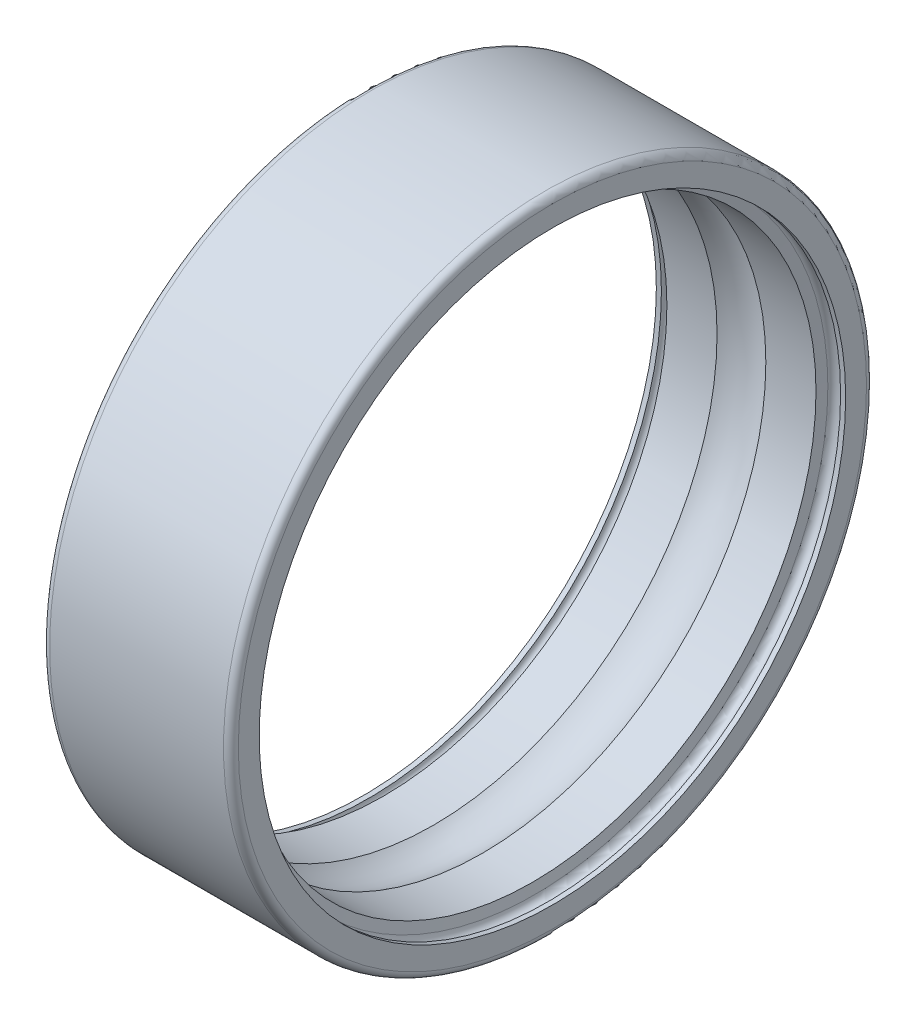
ISO-10303-21;
HEADER;
FILE_DESCRIPTION(('STEP AP214'),'2;1');
FILE_NAME('part.step','',(''),(''),'','','');
FILE_SCHEMA(('AUTOMOTIVE_DESIGN { 1 0 10303 214 1 1 1 1 }'));
ENDSEC;
DATA;
#1=APPLICATION_CONTEXT('core data for automotive mechanical design processes');
#2=APPLICATION_PROTOCOL_DEFINITION('international standard','automotive_design',2000,#1);
#3=PRODUCT_CONTEXT('',#1,'mechanical');
#4=PRODUCT('Part','Part','',(#3));
#5=PRODUCT_RELATED_PRODUCT_CATEGORY('part','',(#4));
#6=PRODUCT_DEFINITION_FORMATION('','',#4);
#7=PRODUCT_DEFINITION_CONTEXT('part definition',#1,'design');
#8=PRODUCT_DEFINITION('design','',#6,#7);
#9=PRODUCT_DEFINITION_SHAPE('','',#8);
#10=(LENGTH_UNIT() NAMED_UNIT(*) SI_UNIT(.MILLI.,.METRE.));
#11=(NAMED_UNIT(*) PLANE_ANGLE_UNIT() SI_UNIT($,.RADIAN.));
#12=(NAMED_UNIT(*) SI_UNIT($,.STERADIAN.) SOLID_ANGLE_UNIT());
#13=UNCERTAINTY_MEASURE_WITH_UNIT(LENGTH_MEASURE(1.E-05),#10,'distance_accuracy_value','');
#14=(GEOMETRIC_REPRESENTATION_CONTEXT(3) GLOBAL_UNCERTAINTY_ASSIGNED_CONTEXT((#13)) GLOBAL_UNIT_ASSIGNED_CONTEXT((#10,
#11,#12)) REPRESENTATION_CONTEXT('',''));
#15=CARTESIAN_POINT('',(0.,0.,0.));
#16=DIRECTION('',(0.,0.,1.));
#17=DIRECTION('',(1.,0.,0.));
#18=AXIS2_PLACEMENT_3D('',#15,#16,#17);
#19=CARTESIAN_POINT('',(0.200000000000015,0.,0.));
#20=DIRECTION('',(1.,0.,0.));
#21=DIRECTION('',(0.,0.,-1.));
#22=AXIS2_PLACEMENT_3D('',#19,#20,#21);
#23=TOROIDAL_SURFACE('',#22,8.29999999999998,0.200000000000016);
#24=CARTESIAN_POINT('',(0.,0.,0.));
#25=DIRECTION('',(1.,0.,0.));
#26=DIRECTION('',(0.,0.,-1.));
#27=AXIS2_PLACEMENT_3D('',#24,#25,#26);
#28=CIRCLE('',#27,8.29999999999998);
#29=CARTESIAN_POINT('',(0.,0.,-8.29999999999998));
#30=VERTEX_POINT('',#29);
#31=EDGE_CURVE('E10',#30,#30,#28,.T.);
#32=ORIENTED_EDGE('',*,*,#31,.T.);
#33=EDGE_LOOP('',(#32));
#34=FACE_BOUND('',#33,.T.);
#35=CARTESIAN_POINT('',(0.199999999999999,0.,0.));
#36=DIRECTION('',(1.,0.,0.));
#37=DIRECTION('',(0.,0.,-1.));
#38=AXIS2_PLACEMENT_3D('',#35,#36,#37);
#39=CIRCLE('',#38,8.5);
#40=CARTESIAN_POINT('',(0.199999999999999,0.,-8.5));
#41=VERTEX_POINT('',#40);
#42=EDGE_CURVE('E82',#41,#41,#39,.T.);
#43=ORIENTED_EDGE('',*,*,#42,.F.);
#44=EDGE_LOOP('',(#43));
#45=FACE_BOUND('',#44,.T.);
#46=ADVANCED_FACE('F36',(#34,#45),#23,.T.);
#47=CARTESIAN_POINT('',(0.,8.29999999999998,0.));
#48=DIRECTION('',(-1.,0.,0.));
#49=DIRECTION('',(0.,0.,1.));
#50=AXIS2_PLACEMENT_3D('',#47,#48,#49);
#51=PLANE('',#50);
#52=CARTESIAN_POINT('',(0.,0.,0.));
#53=DIRECTION('',(1.,0.,0.));
#54=DIRECTION('',(0.,0.,-1.));
#55=AXIS2_PLACEMENT_3D('',#52,#53,#54);
#56=CIRCLE('',#55,7.74874355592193);
#57=CARTESIAN_POINT('',(0.,0.,-7.74874355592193));
#58=VERTEX_POINT('',#57);
#59=EDGE_CURVE('E42',#58,#58,#56,.T.);
#60=ORIENTED_EDGE('',*,*,#59,.T.);
#61=EDGE_LOOP('',(#60));
#62=FACE_BOUND('',#61,.T.);
#63=ORIENTED_EDGE('',*,*,#31,.F.);
#64=EDGE_LOOP('',(#63));
#65=FACE_BOUND('',#64,.T.);
#66=ADVANCED_FACE('F90',(#62,#65),#51,.T.);
#67=CARTESIAN_POINT('',(0.,0.,0.));
#68=DIRECTION('',(1.,0.,0.));
#69=DIRECTION('',(0.,0.,-1.));
#70=AXIS2_PLACEMENT_3D('',#67,#68,#69);
#71=CONICAL_SURFACE('',#70,7.74874355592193,0.00161545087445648);
#72=CARTESIAN_POINT('',(0.133966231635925,0.,0.));
#73=DIRECTION('',(1.,0.,0.));
#74=DIRECTION('',(0.,0.,-1.));
#75=AXIS2_PLACEMENT_3D('',#72,#73,#74);
#76=CIRCLE('',#75,7.74895997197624);
#77=CARTESIAN_POINT('',(0.133966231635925,0.,-7.74895997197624));
#78=VERTEX_POINT('',#77);
#79=EDGE_CURVE('E46',#78,#78,#76,.T.);
#80=ORIENTED_EDGE('',*,*,#79,.T.);
#81=EDGE_LOOP('',(#80));
#82=FACE_BOUND('',#81,.T.);
#83=ORIENTED_EDGE('',*,*,#59,.F.);
#84=EDGE_LOOP('',(#83));
#85=FACE_BOUND('',#84,.T.);
#86=ADVANCED_FACE('F94',(#82,#85),#71,.F.);
#87=CARTESIAN_POINT('',(0.309274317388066,0.,0.));
#88=DIRECTION('',(1.,0.,0.));
#89=DIRECTION('',(0.,0.,-1.));
#90=AXIS2_PLACEMENT_3D('',#87,#88,#89);
#91=TOROIDAL_SURFACE('',#90,7.73798977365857,0.175650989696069);
#92=CARTESIAN_POINT('',(0.482429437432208,0.,0.));
#93=DIRECTION('',(1.,0.,0.));
#94=DIRECTION('',(0.,0.,-1.));
#95=AXIS2_PLACEMENT_3D('',#92,#93,#94);
#96=CIRCLE('',#95,7.76749527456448);
#97=CARTESIAN_POINT('',(0.482429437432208,0.,-7.76749527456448));
#98=VERTEX_POINT('',#97);
#99=EDGE_CURVE('E50',#98,#98,#96,.T.);
#100=ORIENTED_EDGE('',*,*,#99,.T.);
#101=EDGE_LOOP('',(#100));
#102=FACE_BOUND('',#101,.T.);
#103=ORIENTED_EDGE('',*,*,#79,.F.);
#104=EDGE_LOOP('',(#103));
#105=FACE_BOUND('',#104,.T.);
#106=ADVANCED_FACE('F98',(#102,#105),#91,.F.);
#107=CARTESIAN_POINT('',(0.482429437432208,0.,0.));
#108=DIRECTION('',(-1.,0.,0.));
#109=DIRECTION('',(0.,0.,1.));
#110=AXIS2_PLACEMENT_3D('',#107,#108,#109);
#111=CONICAL_SURFACE('',#110,7.76749527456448,1.40201816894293);
#112=CARTESIAN_POINT('',(0.528010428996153,0.,0.));
#113=DIRECTION('',(1.,0.,0.));
#114=DIRECTION('',(0.,0.,-1.));
#115=AXIS2_PLACEMENT_3D('',#112,#113,#114);
#116=CIRCLE('',#115,7.5);
#117=CARTESIAN_POINT('',(0.528010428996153,0.,-7.5));
#118=VERTEX_POINT('',#117);
#119=EDGE_CURVE('E55',#118,#118,#116,.T.);
#120=ORIENTED_EDGE('',*,*,#119,.T.);
#121=EDGE_LOOP('',(#120));
#122=FACE_BOUND('',#121,.T.);
#123=ORIENTED_EDGE('',*,*,#99,.F.);
#124=EDGE_LOOP('',(#123));
#125=FACE_BOUND('',#124,.T.);
#126=ADVANCED_FACE('F105',(#122,#125),#111,.F.);
#127=CARTESIAN_POINT('',(50.,0.,0.));
#128=DIRECTION('',(1.,0.,0.));
#129=DIRECTION('',(0.,0.,-1.));
#130=AXIS2_PLACEMENT_3D('',#127,#128,#129);
#131=CYLINDRICAL_SURFACE('',#130,7.5);
#132=CARTESIAN_POINT('',(1.8549418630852,0.,0.));
#133=DIRECTION('',(1.,0.,0.));
#134=DIRECTION('',(0.,0.,-1.));
#135=AXIS2_PLACEMENT_3D('',#132,#133,#134);
#136=CIRCLE('',#135,7.5);
#137=CARTESIAN_POINT('',(1.8549418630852,0.,-7.5));
#138=VERTEX_POINT('',#137);
#139=EDGE_CURVE('E58',#138,#138,#136,.T.);
#140=ORIENTED_EDGE('',*,*,#139,.T.);
#141=EDGE_LOOP('',(#140));
#142=FACE_BOUND('',#141,.T.);
#143=ORIENTED_EDGE('',*,*,#119,.F.);
#144=EDGE_LOOP('',(#143));
#145=FACE_BOUND('',#144,.T.);
#146=ADVANCED_FACE('F109',(#142,#145),#131,.F.);
#147=CARTESIAN_POINT('',(2.50000000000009,0.,0.));
#148=DIRECTION('',(1.,0.,0.));
#149=DIRECTION('',(0.,0.,-1.));
#150=AXIS2_PLACEMENT_3D('',#147,#148,#149);
#151=TOROIDAL_SURFACE('',#150,6.49999999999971,1.19000000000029);
#152=CARTESIAN_POINT('',(3.14505813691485,0.,0.));
#153=DIRECTION('',(1.,0.,0.));
#154=DIRECTION('',(0.,0.,-1.));
#155=AXIS2_PLACEMENT_3D('',#152,#153,#154);
#156=CIRCLE('',#155,7.50000000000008);
#157=CARTESIAN_POINT('',(3.14505813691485,0.,-7.50000000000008));
#158=VERTEX_POINT('',#157);
#159=EDGE_CURVE('E61',#158,#158,#156,.T.);
#160=ORIENTED_EDGE('',*,*,#159,.T.);
#161=EDGE_LOOP('',(#160));
#162=FACE_BOUND('',#161,.T.);
#163=ORIENTED_EDGE('',*,*,#139,.F.);
#164=EDGE_LOOP('',(#163));
#165=FACE_BOUND('',#164,.T.);
#166=ADVANCED_FACE('F113',(#162,#165),#151,.F.);
#167=CARTESIAN_POINT('',(50.,0.,0.));
#168=DIRECTION('',(1.,0.,0.));
#169=DIRECTION('',(0.,0.,-1.));
#170=AXIS2_PLACEMENT_3D('',#167,#168,#169);
#171=CYLINDRICAL_SURFACE('',#170,7.50000000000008);
#172=CARTESIAN_POINT('',(4.4719895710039,0.,0.));
#173=DIRECTION('',(1.,0.,0.));
#174=DIRECTION('',(0.,0.,-1.));
#175=AXIS2_PLACEMENT_3D('',#172,#173,#174);
#176=CIRCLE('',#175,7.50000000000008);
#177=CARTESIAN_POINT('',(4.4719895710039,0.,-7.50000000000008));
#178=VERTEX_POINT('',#177);
#179=EDGE_CURVE('E64',#178,#178,#176,.T.);
#180=ORIENTED_EDGE('',*,*,#179,.T.);
#181=EDGE_LOOP('',(#180));
#182=FACE_BOUND('',#181,.T.);
#183=ORIENTED_EDGE('',*,*,#159,.F.);
#184=EDGE_LOOP('',(#183));
#185=FACE_BOUND('',#184,.T.);
#186=ADVANCED_FACE('F117',(#182,#185),#171,.F.);
#187=CARTESIAN_POINT('',(4.4719895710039,0.,0.));
#188=DIRECTION('',(1.,0.,0.));
#189=DIRECTION('',(0.,0.,-1.));
#190=AXIS2_PLACEMENT_3D('',#187,#188,#189);
#191=CONICAL_SURFACE('',#190,7.50000000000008,1.39899685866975);
#192=CARTESIAN_POINT('',(4.51837853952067,0.,0.));
#193=DIRECTION('',(1.,0.,0.));
#194=DIRECTION('',(0.,0.,-1.));
#195=AXIS2_PLACEMENT_3D('',#192,#193,#194);
#196=CIRCLE('',#195,7.76735633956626);
#197=CARTESIAN_POINT('',(4.51837853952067,0.,-7.76735633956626));
#198=VERTEX_POINT('',#197);
#199=EDGE_CURVE('E67',#198,#198,#196,.T.);
#200=ORIENTED_EDGE('',*,*,#199,.T.);
#201=EDGE_LOOP('',(#200));
#202=FACE_BOUND('',#201,.T.);
#203=ORIENTED_EDGE('',*,*,#179,.F.);
#204=EDGE_LOOP('',(#203));
#205=FACE_BOUND('',#204,.T.);
#206=ADVANCED_FACE('F121',(#202,#205),#191,.F.);
#207=CARTESIAN_POINT('',(4.69144372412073,0.,0.));
#208=DIRECTION('',(1.,0.,0.));
#209=DIRECTION('',(0.,0.,-1.));
#210=AXIS2_PLACEMENT_3D('',#207,#208,#209);
#211=TOROIDAL_SURFACE('',#210,7.7373278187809,0.175650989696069);
#212=CARTESIAN_POINT('',(4.86603376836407,0.,0.));
#213=DIRECTION('',(1.,0.,0.));
#214=DIRECTION('',(0.,0.,-1.));
#215=AXIS2_PLACEMENT_3D('',#212,#213,#214);
#216=CIRCLE('',#215,7.75660440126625);
#217=CARTESIAN_POINT('',(4.86603376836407,0.,-7.75660440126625));
#218=VERTEX_POINT('',#217);
#219=EDGE_CURVE('E70',#218,#218,#216,.T.);
#220=ORIENTED_EDGE('',*,*,#219,.T.);
#221=EDGE_LOOP('',(#220));
#222=FACE_BOUND('',#221,.T.);
#223=ORIENTED_EDGE('',*,*,#199,.F.);
#224=EDGE_LOOP('',(#223));
#225=FACE_BOUND('',#224,.T.);
#226=ADVANCED_FACE('F125',(#222,#225),#211,.F.);
#227=CARTESIAN_POINT('',(4.86603376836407,0.,0.));
#228=DIRECTION('',(1.,0.,0.));
#229=DIRECTION('',(0.,0.,-1.));
#230=AXIS2_PLACEMENT_3D('',#227,#228,#229);
#231=CONICAL_SURFACE('',#230,7.75660440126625,0.00161545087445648);
#232=CARTESIAN_POINT('',(5.,0.,0.));
#233=DIRECTION('',(1.,0.,0.));
#234=DIRECTION('',(0.,0.,-1.));
#235=AXIS2_PLACEMENT_3D('',#232,#233,#234);
#236=CIRCLE('',#235,7.75682081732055);
#237=CARTESIAN_POINT('',(5.,0.,-7.75682081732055));
#238=VERTEX_POINT('',#237);
#239=EDGE_CURVE('E73',#238,#238,#236,.T.);
#240=ORIENTED_EDGE('',*,*,#239,.T.);
#241=EDGE_LOOP('',(#240));
#242=FACE_BOUND('',#241,.T.);
#243=ORIENTED_EDGE('',*,*,#219,.F.);
#244=EDGE_LOOP('',(#243));
#245=FACE_BOUND('',#244,.T.);
#246=ADVANCED_FACE('F129',(#242,#245),#231,.F.);
#247=CARTESIAN_POINT('',(5.,7.75682081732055,0.));
#248=DIRECTION('',(1.,0.,0.));
#249=DIRECTION('',(0.,0.,-1.));
#250=AXIS2_PLACEMENT_3D('',#247,#248,#249);
#251=PLANE('',#250);
#252=CARTESIAN_POINT('',(5.,0.,0.));
#253=DIRECTION('',(1.,0.,0.));
#254=DIRECTION('',(0.,0.,-1.));
#255=AXIS2_PLACEMENT_3D('',#252,#253,#254);
#256=CIRCLE('',#255,8.3080772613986);
#257=CARTESIAN_POINT('',(5.,0.,-8.3080772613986));
#258=VERTEX_POINT('',#257);
#259=EDGE_CURVE('E76',#258,#258,#256,.T.);
#260=ORIENTED_EDGE('',*,*,#259,.T.);
#261=EDGE_LOOP('',(#260));
#262=FACE_BOUND('',#261,.T.);
#263=ORIENTED_EDGE('',*,*,#239,.F.);
#264=EDGE_LOOP('',(#263));
#265=FACE_BOUND('',#264,.T.);
#266=ADVANCED_FACE('F133',(#262,#265),#251,.T.);
#267=CARTESIAN_POINT('',(4.80791415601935,0.,0.));
#268=DIRECTION('',(1.,0.,0.));
#269=DIRECTION('',(0.,0.,-1.));
#270=AXIS2_PLACEMENT_3D('',#267,#268,#269);
#271=TOROIDAL_SURFACE('',#270,8.3080772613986,0.19208584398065);
#272=CARTESIAN_POINT('',(4.8,0.,0.));
#273=DIRECTION('',(1.,0.,0.));
#274=DIRECTION('',(0.,0.,-1.));
#275=AXIS2_PLACEMENT_3D('',#272,#273,#274);
#276=CIRCLE('',#275,8.5);
#277=CARTESIAN_POINT('',(4.8,0.,-8.5));
#278=VERTEX_POINT('',#277);
#279=EDGE_CURVE('E79',#278,#278,#276,.T.);
#280=ORIENTED_EDGE('',*,*,#279,.T.);
#281=EDGE_LOOP('',(#280));
#282=FACE_BOUND('',#281,.T.);
#283=ORIENTED_EDGE('',*,*,#259,.F.);
#284=EDGE_LOOP('',(#283));
#285=FACE_BOUND('',#284,.T.);
#286=ADVANCED_FACE('F137',(#282,#285),#271,.T.);
#287=CARTESIAN_POINT('',(50.,0.,0.));
#288=DIRECTION('',(1.,0.,0.));
#289=DIRECTION('',(0.,0.,-1.));
#290=AXIS2_PLACEMENT_3D('',#287,#288,#289);
#291=CYLINDRICAL_SURFACE('',#290,8.5);
#292=ORIENTED_EDGE('',*,*,#42,.T.);
#293=EDGE_LOOP('',(#292));
#294=FACE_BOUND('',#293,.T.);
#295=ORIENTED_EDGE('',*,*,#279,.F.);
#296=EDGE_LOOP('',(#295));
#297=FACE_BOUND('',#296,.T.);
#298=ADVANCED_FACE('F86',(#294,#297),#291,.T.);
#299=CLOSED_SHELL('',(#46,#66,#86,#106,#126,#146,#166,#186,#206,#226,#246,#266,#286,#298));
#300=MANIFOLD_SOLID_BREP('B2',#299);
#301=ADVANCED_BREP_SHAPE_REPRESENTATION('',(#18,#300),#14);
#302=SHAPE_DEFINITION_REPRESENTATION(#9,#301);
ENDSEC;
END-ISO-10303-21;
